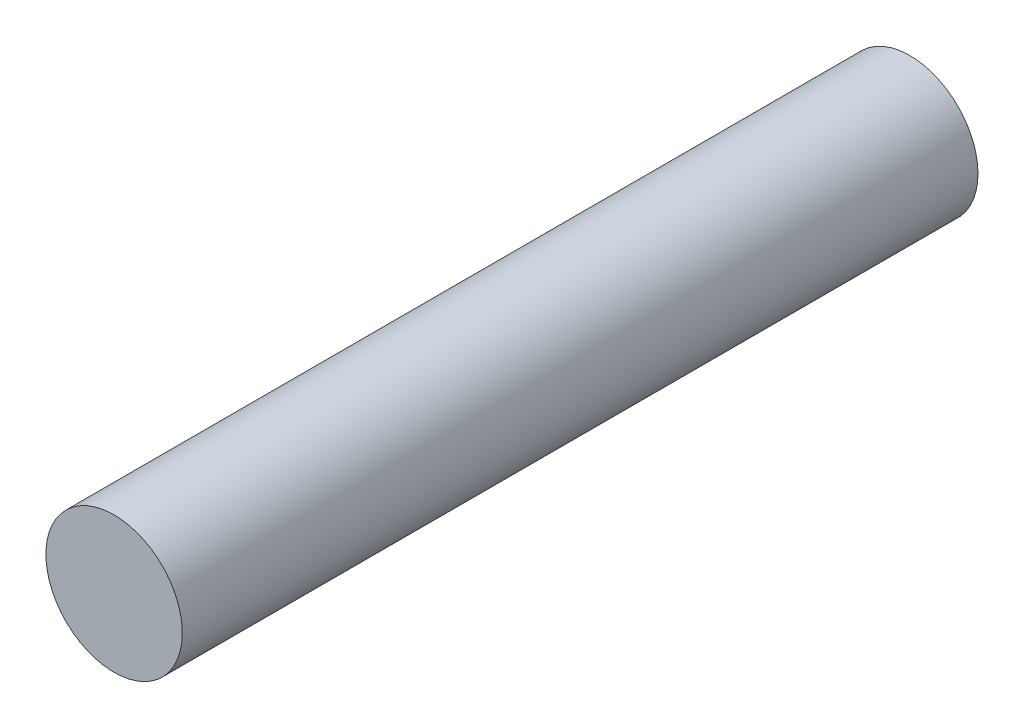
ISO-10303-21;
HEADER;
FILE_DESCRIPTION(('STEP AP214'),'2;1');
FILE_NAME('part.step','',(''),(''),'','','');
FILE_SCHEMA(('AUTOMOTIVE_DESIGN { 1 0 10303 214 1 1 1 1 }'));
ENDSEC;
DATA;
#1=APPLICATION_CONTEXT('core data for automotive mechanical design processes');
#2=APPLICATION_PROTOCOL_DEFINITION('international standard','automotive_design',2000,#1);
#3=PRODUCT_CONTEXT('',#1,'mechanical');
#4=PRODUCT('Part','Part','',(#3));
#5=PRODUCT_RELATED_PRODUCT_CATEGORY('part','',(#4));
#6=PRODUCT_DEFINITION_FORMATION('','',#4);
#7=PRODUCT_DEFINITION_CONTEXT('part definition',#1,'design');
#8=PRODUCT_DEFINITION('design','',#6,#7);
#9=PRODUCT_DEFINITION_SHAPE('','',#8);
#10=(LENGTH_UNIT() NAMED_UNIT(*) SI_UNIT(.MILLI.,.METRE.));
#11=(NAMED_UNIT(*) PLANE_ANGLE_UNIT() SI_UNIT($,.RADIAN.));
#12=(NAMED_UNIT(*) SI_UNIT($,.STERADIAN.) SOLID_ANGLE_UNIT());
#13=UNCERTAINTY_MEASURE_WITH_UNIT(LENGTH_MEASURE(1.E-05),#10,'distance_accuracy_value','');
#14=(GEOMETRIC_REPRESENTATION_CONTEXT(3) GLOBAL_UNCERTAINTY_ASSIGNED_CONTEXT((#13)) GLOBAL_UNIT_ASSIGNED_CONTEXT((#10,
#11,#12)) REPRESENTATION_CONTEXT('',''));
#15=CARTESIAN_POINT('',(0.,0.,0.));
#16=DIRECTION('',(0.,0.,1.));
#17=DIRECTION('',(1.,0.,0.));
#18=AXIS2_PLACEMENT_3D('',#15,#16,#17);
#19=CARTESIAN_POINT('',(0.,0.,-350.));
#20=DIRECTION('',(0.,0.,1.));
#21=DIRECTION('',(1.,0.,0.));
#22=AXIS2_PLACEMENT_3D('',#19,#20,#21);
#23=CYLINDRICAL_SURFACE('',#22,30.);
#24=CARTESIAN_POINT('',(0.,0.,-350.));
#25=DIRECTION('',(0.,0.,1.));
#26=DIRECTION('',(1.,0.,0.));
#27=AXIS2_PLACEMENT_3D('',#24,#25,#26);
#28=CIRCLE('',#27,30.);
#29=CARTESIAN_POINT('',(30.,0.,-350.));
#30=VERTEX_POINT('',#29);
#31=EDGE_CURVE('E10',#30,#30,#28,.T.);
#32=ORIENTED_EDGE('',*,*,#31,.T.);
#33=EDGE_LOOP('',(#32));
#34=FACE_BOUND('',#33,.T.);
#35=CARTESIAN_POINT('',(0.,0.,0.));
#36=DIRECTION('',(0.,0.,1.));
#37=DIRECTION('',(1.,0.,0.));
#38=AXIS2_PLACEMENT_3D('',#35,#36,#37);
#39=CIRCLE('',#38,30.);
#40=CARTESIAN_POINT('',(30.,0.,0.));
#41=VERTEX_POINT('',#40);
#42=EDGE_CURVE('E40',#41,#41,#39,.T.);
#43=ORIENTED_EDGE('',*,*,#42,.F.);
#44=EDGE_LOOP('',(#43));
#45=FACE_BOUND('',#44,.T.);
#46=ADVANCED_FACE('F37',(#34,#45),#23,.T.);
#47=CARTESIAN_POINT('',(0.,0.,-350.));
#48=DIRECTION('',(0.,0.,1.));
#49=DIRECTION('',(1.,0.,0.));
#50=AXIS2_PLACEMENT_3D('',#47,#48,#49);
#51=PLANE('',#50);
#52=ORIENTED_EDGE('',*,*,#31,.F.);
#53=EDGE_LOOP('',(#52));
#54=FACE_BOUND('',#53,.T.);
#55=ADVANCED_FACE('F54',(#54),#51,.F.);
#56=CARTESIAN_POINT('',(0.,0.,0.));
#57=DIRECTION('',(0.,0.,1.));
#58=DIRECTION('',(1.,0.,0.));
#59=AXIS2_PLACEMENT_3D('',#56,#57,#58);
#60=PLANE('',#59);
#61=ORIENTED_EDGE('',*,*,#42,.T.);
#62=EDGE_LOOP('',(#61));
#63=FACE_BOUND('',#62,.T.);
#64=ADVANCED_FACE('F51',(#63),#60,.T.);
#65=CLOSED_SHELL('',(#46,#55,#64));
#66=MANIFOLD_SOLID_BREP('B2',#65);
#67=ADVANCED_BREP_SHAPE_REPRESENTATION('',(#18,#66),#14);
#68=SHAPE_DEFINITION_REPRESENTATION(#9,#67);
ENDSEC;
END-ISO-10303-21;
